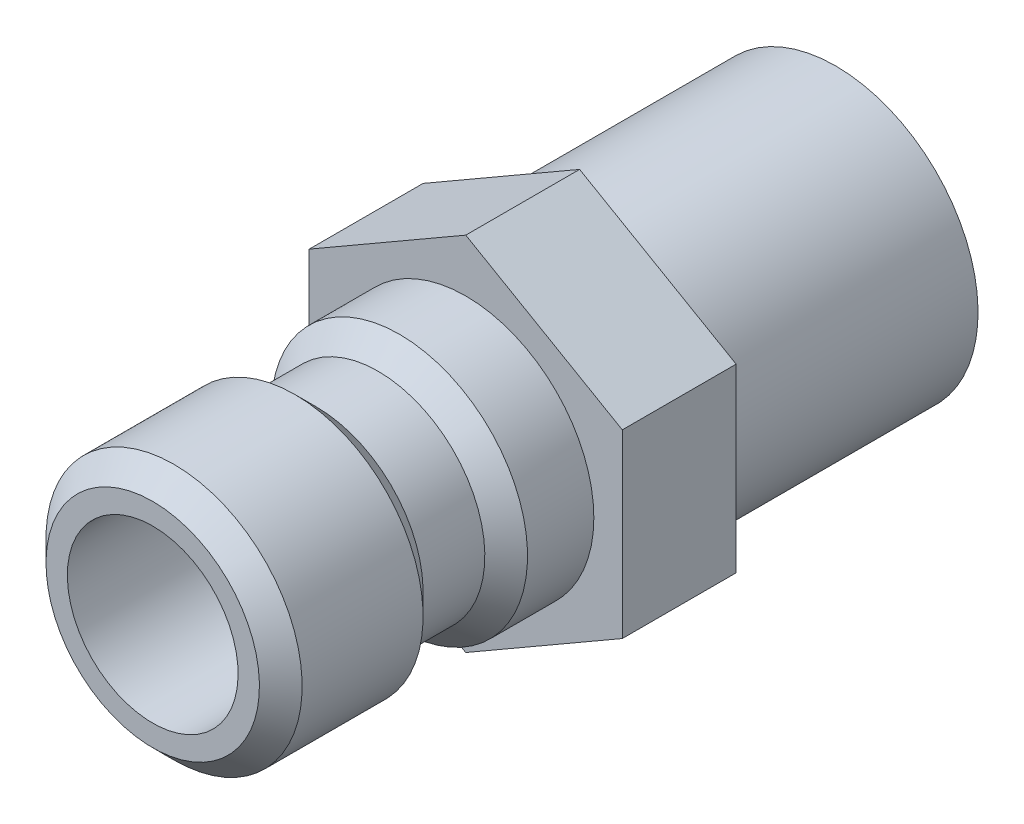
ISO-10303-21;
HEADER;
FILE_DESCRIPTION(('STEP AP214'),'2;1');
FILE_NAME('part.step','',(''),(''),'','','');
FILE_SCHEMA(('AUTOMOTIVE_DESIGN { 1 0 10303 214 1 1 1 1 }'));
ENDSEC;
DATA;
#1=APPLICATION_CONTEXT('core data for automotive mechanical design processes');
#2=APPLICATION_PROTOCOL_DEFINITION('international standard','automotive_design',2000,#1);
#3=PRODUCT_CONTEXT('',#1,'mechanical');
#4=PRODUCT('Part','Part','',(#3));
#5=PRODUCT_RELATED_PRODUCT_CATEGORY('part','',(#4));
#6=PRODUCT_DEFINITION_FORMATION('','',#4);
#7=PRODUCT_DEFINITION_CONTEXT('part definition',#1,'design');
#8=PRODUCT_DEFINITION('design','',#6,#7);
#9=PRODUCT_DEFINITION_SHAPE('','',#8);
#10=(LENGTH_UNIT() NAMED_UNIT(*) SI_UNIT(.MILLI.,.METRE.));
#11=(NAMED_UNIT(*) PLANE_ANGLE_UNIT() SI_UNIT($,.RADIAN.));
#12=(NAMED_UNIT(*) SI_UNIT($,.STERADIAN.) SOLID_ANGLE_UNIT());
#13=UNCERTAINTY_MEASURE_WITH_UNIT(LENGTH_MEASURE(1.E-05),#10,'distance_accuracy_value','');
#14=(GEOMETRIC_REPRESENTATION_CONTEXT(3) GLOBAL_UNCERTAINTY_ASSIGNED_CONTEXT((#13)) GLOBAL_UNIT_ASSIGNED_CONTEXT((#10,
#11,#12)) REPRESENTATION_CONTEXT('',''));
#15=CARTESIAN_POINT('',(0.,0.,0.));
#16=DIRECTION('',(0.,0.,1.));
#17=DIRECTION('',(1.,0.,0.));
#18=AXIS2_PLACEMENT_3D('',#15,#16,#17);
#19=CARTESIAN_POINT('',(0.,0.,-4.));
#20=DIRECTION('',(0.,0.,-1.));
#21=DIRECTION('',(0.,1.,0.));
#22=AXIS2_PLACEMENT_3D('',#19,#20,#21);
#23=CYLINDRICAL_SURFACE('',#22,3.);
#24=CARTESIAN_POINT('',(0.,0.,11.));
#25=DIRECTION('',(0.,0.,-1.));
#26=DIRECTION('',(0.,1.,0.));
#27=AXIS2_PLACEMENT_3D('',#24,#25,#26);
#28=CIRCLE('',#27,3.);
#29=CARTESIAN_POINT('',(0.,3.,11.));
#30=VERTEX_POINT('',#29);
#31=EDGE_CURVE('E40',#30,#30,#28,.T.);
#32=ORIENTED_EDGE('',*,*,#31,.F.);
#33=EDGE_LOOP('',(#32));
#34=FACE_BOUND('',#33,.T.);
#35=CARTESIAN_POINT('',(0.,0.,-13.));
#36=DIRECTION('',(0.,0.,-1.));
#37=DIRECTION('',(0.,1.,0.));
#38=AXIS2_PLACEMENT_3D('',#35,#36,#37);
#39=CIRCLE('',#38,3.);
#40=CARTESIAN_POINT('',(0.,3.,-13.));
#41=VERTEX_POINT('',#40);
#42=EDGE_CURVE('E144',#41,#41,#39,.T.);
#43=ORIENTED_EDGE('',*,*,#42,.T.);
#44=EDGE_LOOP('',(#43));
#45=FACE_BOUND('',#44,.T.);
#46=ADVANCED_FACE('F32',(#34,#45),#23,.F.);
#47=CARTESIAN_POINT('',(0.,3.,11.));
#48=DIRECTION('',(0.,0.,1.));
#49=DIRECTION('',(0.,-1.,0.));
#50=AXIS2_PLACEMENT_3D('',#47,#48,#49);
#51=PLANE('',#50);
#52=ORIENTED_EDGE('',*,*,#31,.T.);
#53=EDGE_LOOP('',(#52));
#54=FACE_BOUND('',#53,.T.);
#55=CARTESIAN_POINT('',(0.,0.,11.));
#56=DIRECTION('',(0.,0.,-1.));
#57=DIRECTION('',(0.,1.,0.));
#58=AXIS2_PLACEMENT_3D('',#55,#56,#57);
#59=CIRCLE('',#58,3.75);
#60=CARTESIAN_POINT('',(0.,3.75,11.));
#61=VERTEX_POINT('',#60);
#62=EDGE_CURVE('E165',#61,#61,#59,.T.);
#63=ORIENTED_EDGE('',*,*,#62,.F.);
#64=EDGE_LOOP('',(#63));
#65=FACE_BOUND('',#64,.T.);
#66=ADVANCED_FACE('F170',(#54,#65),#51,.T.);
#67=CARTESIAN_POINT('',(0.,0.,10.25));
#68=DIRECTION('',(0.,0.,-1.));
#69=DIRECTION('',(0.,1.,0.));
#70=AXIS2_PLACEMENT_3D('',#67,#68,#69);
#71=CONICAL_SURFACE('',#70,4.5,0.785398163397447);
#72=ORIENTED_EDGE('',*,*,#62,.T.);
#73=EDGE_LOOP('',(#72));
#74=FACE_BOUND('',#73,.T.);
#75=CARTESIAN_POINT('',(0.,0.,10.25));
#76=DIRECTION('',(0.,0.,-1.));
#77=DIRECTION('',(0.,1.,0.));
#78=AXIS2_PLACEMENT_3D('',#75,#76,#77);
#79=CIRCLE('',#78,4.5);
#80=CARTESIAN_POINT('',(0.,4.5,10.25));
#81=VERTEX_POINT('',#80);
#82=EDGE_CURVE('E162',#81,#81,#79,.T.);
#83=ORIENTED_EDGE('',*,*,#82,.F.);
#84=EDGE_LOOP('',(#83));
#85=FACE_BOUND('',#84,.T.);
#86=ADVANCED_FACE('F212',(#74,#85),#71,.T.);
#87=CARTESIAN_POINT('',(0.,0.,-4.));
#88=DIRECTION('',(0.,0.,-1.));
#89=DIRECTION('',(0.,1.,0.));
#90=AXIS2_PLACEMENT_3D('',#87,#88,#89);
#91=CYLINDRICAL_SURFACE('',#90,4.5);
#92=ORIENTED_EDGE('',*,*,#82,.T.);
#93=EDGE_LOOP('',(#92));
#94=FACE_BOUND('',#93,.T.);
#95=CARTESIAN_POINT('',(0.,0.,6.));
#96=DIRECTION('',(0.,0.,-1.));
#97=DIRECTION('',(0.,1.,0.));
#98=AXIS2_PLACEMENT_3D('',#95,#96,#97);
#99=CIRCLE('',#98,4.5);
#100=CARTESIAN_POINT('',(0.,4.5,6.));
#101=VERTEX_POINT('',#100);
#102=EDGE_CURVE('E159',#101,#101,#99,.T.);
#103=ORIENTED_EDGE('',*,*,#102,.F.);
#104=EDGE_LOOP('',(#103));
#105=FACE_BOUND('',#104,.T.);
#106=ADVANCED_FACE('F208',(#94,#105),#91,.T.);
#107=CARTESIAN_POINT('',(0.,0.,5.25));
#108=DIRECTION('',(0.,0.,1.));
#109=DIRECTION('',(0.,-1.,0.));
#110=AXIS2_PLACEMENT_3D('',#107,#108,#109);
#111=CONICAL_SURFACE('',#110,3.75,0.785398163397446);
#112=ORIENTED_EDGE('',*,*,#102,.T.);
#113=EDGE_LOOP('',(#112));
#114=FACE_BOUND('',#113,.T.);
#115=CARTESIAN_POINT('',(0.,0.,5.25));
#116=DIRECTION('',(0.,0.,-1.));
#117=DIRECTION('',(0.,1.,0.));
#118=AXIS2_PLACEMENT_3D('',#115,#116,#117);
#119=CIRCLE('',#118,3.75);
#120=CARTESIAN_POINT('',(0.,3.75,5.25));
#121=VERTEX_POINT('',#120);
#122=EDGE_CURVE('E156',#121,#121,#119,.T.);
#123=ORIENTED_EDGE('',*,*,#122,.F.);
#124=EDGE_LOOP('',(#123));
#125=FACE_BOUND('',#124,.T.);
#126=ADVANCED_FACE('F204',(#114,#125),#111,.T.);
#127=CARTESIAN_POINT('',(0.,0.,-4.));
#128=DIRECTION('',(0.,0.,-1.));
#129=DIRECTION('',(0.,1.,0.));
#130=AXIS2_PLACEMENT_3D('',#127,#128,#129);
#131=CYLINDRICAL_SURFACE('',#130,3.75);
#132=ORIENTED_EDGE('',*,*,#122,.T.);
#133=EDGE_LOOP('',(#132));
#134=FACE_BOUND('',#133,.T.);
#135=CARTESIAN_POINT('',(0.,0.,3.08));
#136=DIRECTION('',(0.,0.,-1.));
#137=DIRECTION('',(0.,1.,0.));
#138=AXIS2_PLACEMENT_3D('',#135,#136,#137);
#139=CIRCLE('',#138,3.75);
#140=CARTESIAN_POINT('',(0.,3.75,3.08));
#141=VERTEX_POINT('',#140);
#142=EDGE_CURVE('E153',#141,#141,#139,.T.);
#143=ORIENTED_EDGE('',*,*,#142,.F.);
#144=EDGE_LOOP('',(#143));
#145=FACE_BOUND('',#144,.T.);
#146=ADVANCED_FACE('F200',(#134,#145),#131,.T.);
#147=CARTESIAN_POINT('',(0.,0.,2.33));
#148=DIRECTION('',(0.,0.,-1.));
#149=DIRECTION('',(0.,1.,0.));
#150=AXIS2_PLACEMENT_3D('',#147,#148,#149);
#151=CONICAL_SURFACE('',#150,4.5,0.785398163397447);
#152=ORIENTED_EDGE('',*,*,#142,.T.);
#153=EDGE_LOOP('',(#152));
#154=FACE_BOUND('',#153,.T.);
#155=CARTESIAN_POINT('',(0.,0.,2.33));
#156=DIRECTION('',(0.,0.,-1.));
#157=DIRECTION('',(0.,1.,0.));
#158=AXIS2_PLACEMENT_3D('',#155,#156,#157);
#159=CIRCLE('',#158,4.5);
#160=CARTESIAN_POINT('',(0.,4.5,2.33));
#161=VERTEX_POINT('',#160);
#162=EDGE_CURVE('E150',#161,#161,#159,.T.);
#163=ORIENTED_EDGE('',*,*,#162,.F.);
#164=EDGE_LOOP('',(#163));
#165=FACE_BOUND('',#164,.T.);
#166=ADVANCED_FACE('F196',(#154,#165),#151,.T.);
#167=CARTESIAN_POINT('',(0.,0.,-4.));
#168=DIRECTION('',(0.,0.,-1.));
#169=DIRECTION('',(0.,1.,0.));
#170=AXIS2_PLACEMENT_3D('',#167,#168,#169);
#171=CYLINDRICAL_SURFACE('',#170,4.5);
#172=CARTESIAN_POINT('',(0.,0.,0.));
#173=DIRECTION('',(0.,0.,1.));
#174=DIRECTION('',(1.,0.,0.));
#175=AXIS2_PLACEMENT_3D('',#172,#173,#174);
#176=CIRCLE('',#175,4.5);
#177=CARTESIAN_POINT('',(4.5,0.,0.));
#178=VERTEX_POINT('',#177);
#179=EDGE_CURVE('E11',#178,#178,#176,.F.);
#180=ORIENTED_EDGE('',*,*,#179,.F.);
#181=EDGE_LOOP('',(#180));
#182=FACE_BOUND('',#181,.T.);
#183=ORIENTED_EDGE('',*,*,#162,.T.);
#184=EDGE_LOOP('',(#183));
#185=FACE_BOUND('',#184,.T.);
#186=ADVANCED_FACE('F189',(#182,#185),#171,.T.);
#187=CARTESIAN_POINT('',(0.,0.,-4.));
#188=DIRECTION('',(0.,0.,-1.));
#189=DIRECTION('',(0.,1.,0.));
#190=AXIS2_PLACEMENT_3D('',#187,#188,#189);
#191=CYLINDRICAL_SURFACE('',#190,5.);
#192=CARTESIAN_POINT('',(0.,0.,-4.));
#193=DIRECTION('',(0.,0.,1.));
#194=DIRECTION('',(1.,0.,0.));
#195=AXIS2_PLACEMENT_3D('',#192,#193,#194);
#196=CIRCLE('',#195,5.);
#197=CARTESIAN_POINT('',(5.,0.,-4.));
#198=VERTEX_POINT('',#197);
#199=EDGE_CURVE('E136',#198,#198,#196,.F.);
#200=ORIENTED_EDGE('',*,*,#199,.T.);
#201=EDGE_LOOP('',(#200));
#202=FACE_BOUND('',#201,.T.);
#203=CARTESIAN_POINT('',(0.,0.,-13.));
#204=DIRECTION('',(0.,0.,-1.));
#205=DIRECTION('',(0.,1.,0.));
#206=AXIS2_PLACEMENT_3D('',#203,#204,#205);
#207=CIRCLE('',#206,5.);
#208=CARTESIAN_POINT('',(0.,5.,-13.));
#209=VERTEX_POINT('',#208);
#210=EDGE_CURVE('E147',#209,#209,#207,.T.);
#211=ORIENTED_EDGE('',*,*,#210,.F.);
#212=EDGE_LOOP('',(#211));
#213=FACE_BOUND('',#212,.T.);
#214=ADVANCED_FACE('F180',(#202,#213),#191,.T.);
#215=CARTESIAN_POINT('',(0.,5.,-13.));
#216=DIRECTION('',(0.,0.,-1.));
#217=DIRECTION('',(0.,1.,0.));
#218=AXIS2_PLACEMENT_3D('',#215,#216,#217);
#219=PLANE('',#218);
#220=ORIENTED_EDGE('',*,*,#210,.T.);
#221=EDGE_LOOP('',(#220));
#222=FACE_BOUND('',#221,.T.);
#223=ORIENTED_EDGE('',*,*,#42,.F.);
#224=EDGE_LOOP('',(#223));
#225=FACE_BOUND('',#224,.T.);
#226=ADVANCED_FACE('F177',(#222,#225),#219,.T.);
#227=CARTESIAN_POINT('',(0.,6.35085296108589,-4.));
#228=DIRECTION('',(-0.5,0.866025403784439,0.));
#229=DIRECTION('',(-0.866025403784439,-0.5,0.));
#230=AXIS2_PLACEMENT_3D('',#227,#228,#229);
#231=PLANE('',#230);
#232=DIRECTION('',(-0.866025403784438,-0.5,0.));
#233=VECTOR('',#232,1.);
#234=CARTESIAN_POINT('',(0.,6.35085296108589,0.));
#235=LINE('',#234,#233);
#236=CARTESIAN_POINT('',(0.,6.35085296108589,0.));
#237=VERTEX_POINT('',#236);
#238=CARTESIAN_POINT('',(-5.5,3.17542648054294,0.));
#239=VERTEX_POINT('',#238);
#240=EDGE_CURVE('E119',#237,#239,#235,.T.);
#241=ORIENTED_EDGE('',*,*,#240,.F.);
#242=DIRECTION('',(0.,0.,1.));
#243=VECTOR('',#242,1.);
#244=CARTESIAN_POINT('',(0.,6.35085296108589,-4.));
#245=LINE('',#244,#243);
#246=CARTESIAN_POINT('',(0.,6.35085296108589,-4.));
#247=VERTEX_POINT('',#246);
#248=EDGE_CURVE('E48',#247,#237,#245,.T.);
#249=ORIENTED_EDGE('',*,*,#248,.F.);
#250=DIRECTION('',(-0.866025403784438,-0.5,0.));
#251=VECTOR('',#250,1.);
#252=CARTESIAN_POINT('',(0.,6.35085296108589,-4.));
#253=LINE('',#252,#251);
#254=CARTESIAN_POINT('',(-5.5,3.17542648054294,-4.));
#255=VERTEX_POINT('',#254);
#256=EDGE_CURVE('E134',#247,#255,#253,.T.);
#257=ORIENTED_EDGE('',*,*,#256,.T.);
#258=DIRECTION('',(0.,0.,1.));
#259=VECTOR('',#258,1.);
#260=CARTESIAN_POINT('',(-5.5,3.17542648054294,-4.));
#261=LINE('',#260,#259);
#262=EDGE_CURVE('E83',#255,#239,#261,.T.);
#263=ORIENTED_EDGE('',*,*,#262,.T.);
#264=EDGE_LOOP('',(#241,#249,#257,#263));
#265=FACE_BOUND('',#264,.T.);
#266=ADVANCED_FACE('F179',(#265),#231,.T.);
#267=CARTESIAN_POINT('',(5.5,3.17542648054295,-4.));
#268=DIRECTION('',(0.5,0.866025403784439,0.));
#269=DIRECTION('',(-0.866025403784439,0.5,0.));
#270=AXIS2_PLACEMENT_3D('',#267,#268,#269);
#271=PLANE('',#270);
#272=DIRECTION('',(-0.866025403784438,0.5,0.));
#273=VECTOR('',#272,1.);
#274=CARTESIAN_POINT('',(5.5,3.17542648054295,0.));
#275=LINE('',#274,#273);
#276=CARTESIAN_POINT('',(5.5,3.17542648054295,0.));
#277=VERTEX_POINT('',#276);
#278=EDGE_CURVE('E131',#277,#237,#275,.T.);
#279=ORIENTED_EDGE('',*,*,#278,.F.);
#280=DIRECTION('',(0.,0.,1.));
#281=VECTOR('',#280,1.);
#282=CARTESIAN_POINT('',(5.5,3.17542648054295,-4.));
#283=LINE('',#282,#281);
#284=CARTESIAN_POINT('',(5.5,3.17542648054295,-4.));
#285=VERTEX_POINT('',#284);
#286=EDGE_CURVE('E71',#285,#277,#283,.T.);
#287=ORIENTED_EDGE('',*,*,#286,.F.);
#288=DIRECTION('',(-0.866025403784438,0.5,0.));
#289=VECTOR('',#288,1.);
#290=CARTESIAN_POINT('',(5.5,3.17542648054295,-4.));
#291=LINE('',#290,#289);
#292=EDGE_CURVE('E109',#285,#247,#291,.T.);
#293=ORIENTED_EDGE('',*,*,#292,.T.);
#294=ORIENTED_EDGE('',*,*,#248,.T.);
#295=EDGE_LOOP('',(#279,#287,#293,#294));
#296=FACE_BOUND('',#295,.T.);
#297=ADVANCED_FACE('F187',(#296),#271,.T.);
#298=CARTESIAN_POINT('',(5.5,-3.17542648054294,-4.));
#299=DIRECTION('',(1.,0.,0.));
#300=DIRECTION('',(0.,0.,-1.));
#301=AXIS2_PLACEMENT_3D('',#298,#299,#300);
#302=PLANE('',#301);
#303=DIRECTION('',(0.,1.,0.));
#304=VECTOR('',#303,1.);
#305=CARTESIAN_POINT('',(5.5,-3.17542648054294,0.));
#306=LINE('',#305,#304);
#307=CARTESIAN_POINT('',(5.5,-3.17542648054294,0.));
#308=VERTEX_POINT('',#307);
#309=EDGE_CURVE('E96',#308,#277,#306,.T.);
#310=ORIENTED_EDGE('',*,*,#309,.F.);
#311=DIRECTION('',(0.,0.,1.));
#312=VECTOR('',#311,1.);
#313=CARTESIAN_POINT('',(5.5,-3.17542648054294,-4.));
#314=LINE('',#313,#312);
#315=CARTESIAN_POINT('',(5.5,-3.17542648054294,-4.));
#316=VERTEX_POINT('',#315);
#317=EDGE_CURVE('E91',#316,#308,#314,.T.);
#318=ORIENTED_EDGE('',*,*,#317,.F.);
#319=DIRECTION('',(0.,1.,0.));
#320=VECTOR('',#319,1.);
#321=CARTESIAN_POINT('',(5.5,-3.17542648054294,-4.));
#322=LINE('',#321,#320);
#323=EDGE_CURVE('E94',#316,#285,#322,.T.);
#324=ORIENTED_EDGE('',*,*,#323,.T.);
#325=ORIENTED_EDGE('',*,*,#286,.T.);
#326=EDGE_LOOP('',(#310,#318,#324,#325));
#327=FACE_BOUND('',#326,.T.);
#328=ADVANCED_FACE('F93',(#327),#302,.T.);
#329=CARTESIAN_POINT('',(0.,-6.35085296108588,-4.));
#330=DIRECTION('',(0.5,-0.866025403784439,0.));
#331=DIRECTION('',(0.866025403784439,0.5,0.));
#332=AXIS2_PLACEMENT_3D('',#329,#330,#331);
#333=PLANE('',#332);
#334=DIRECTION('',(0.866025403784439,0.5,0.));
#335=VECTOR('',#334,1.);
#336=CARTESIAN_POINT('',(0.,-6.35085296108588,0.));
#337=LINE('',#336,#335);
#338=CARTESIAN_POINT('',(0.,-6.35085296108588,0.));
#339=VERTEX_POINT('',#338);
#340=EDGE_CURVE('E128',#339,#308,#337,.T.);
#341=ORIENTED_EDGE('',*,*,#340,.F.);
#342=DIRECTION('',(0.,0.,1.));
#343=VECTOR('',#342,1.);
#344=CARTESIAN_POINT('',(0.,-6.35085296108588,-4.));
#345=LINE('',#344,#343);
#346=CARTESIAN_POINT('',(0.,-6.35085296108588,-4.));
#347=VERTEX_POINT('',#346);
#348=EDGE_CURVE('E101',#347,#339,#345,.T.);
#349=ORIENTED_EDGE('',*,*,#348,.F.);
#350=DIRECTION('',(0.866025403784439,0.5,0.));
#351=VECTOR('',#350,1.);
#352=CARTESIAN_POINT('',(0.,-6.35085296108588,-4.));
#353=LINE('',#352,#351);
#354=EDGE_CURVE('E107',#347,#316,#353,.T.);
#355=ORIENTED_EDGE('',*,*,#354,.T.);
#356=ORIENTED_EDGE('',*,*,#317,.T.);
#357=EDGE_LOOP('',(#341,#349,#355,#356));
#358=FACE_BOUND('',#357,.T.);
#359=ADVANCED_FACE('F111',(#358),#333,.T.);
#360=CARTESIAN_POINT('',(-5.5,-3.17542648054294,-4.));
#361=DIRECTION('',(-0.5,-0.866025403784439,0.));
#362=DIRECTION('',(0.866025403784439,-0.5,0.));
#363=AXIS2_PLACEMENT_3D('',#360,#361,#362);
#364=PLANE('',#363);
#365=DIRECTION('',(0.866025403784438,-0.5,0.));
#366=VECTOR('',#365,1.);
#367=CARTESIAN_POINT('',(-5.5,-3.17542648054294,0.));
#368=LINE('',#367,#366);
#369=CARTESIAN_POINT('',(-5.5,-3.17542648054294,0.));
#370=VERTEX_POINT('',#369);
#371=EDGE_CURVE('E125',#370,#339,#368,.T.);
#372=ORIENTED_EDGE('',*,*,#371,.F.);
#373=DIRECTION('',(0.,0.,1.));
#374=VECTOR('',#373,1.);
#375=CARTESIAN_POINT('',(-5.5,-3.17542648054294,-4.));
#376=LINE('',#375,#374);
#377=CARTESIAN_POINT('',(-5.5,-3.17542648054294,-4.));
#378=VERTEX_POINT('',#377);
#379=EDGE_CURVE('E139',#378,#370,#376,.T.);
#380=ORIENTED_EDGE('',*,*,#379,.F.);
#381=DIRECTION('',(0.866025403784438,-0.5,0.));
#382=VECTOR('',#381,1.);
#383=CARTESIAN_POINT('',(-5.5,-3.17542648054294,-4.));
#384=LINE('',#383,#382);
#385=EDGE_CURVE('E112',#378,#347,#384,.T.);
#386=ORIENTED_EDGE('',*,*,#385,.T.);
#387=ORIENTED_EDGE('',*,*,#348,.T.);
#388=EDGE_LOOP('',(#372,#380,#386,#387));
#389=FACE_BOUND('',#388,.T.);
#390=ADVANCED_FACE('F303',(#389),#364,.T.);
#391=CARTESIAN_POINT('',(-5.5,3.17542648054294,-4.));
#392=DIRECTION('',(-1.,0.,0.));
#393=DIRECTION('',(0.,0.,1.));
#394=AXIS2_PLACEMENT_3D('',#391,#392,#393);
#395=PLANE('',#394);
#396=DIRECTION('',(0.,-1.,0.));
#397=VECTOR('',#396,1.);
#398=CARTESIAN_POINT('',(-5.5,3.17542648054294,0.));
#399=LINE('',#398,#397);
#400=EDGE_CURVE('E122',#239,#370,#399,.T.);
#401=ORIENTED_EDGE('',*,*,#400,.F.);
#402=ORIENTED_EDGE('',*,*,#262,.F.);
#403=DIRECTION('',(0.,-1.,0.));
#404=VECTOR('',#403,1.);
#405=CARTESIAN_POINT('',(-5.5,3.17542648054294,-4.));
#406=LINE('',#405,#404);
#407=EDGE_CURVE('E114',#255,#378,#406,.T.);
#408=ORIENTED_EDGE('',*,*,#407,.T.);
#409=ORIENTED_EDGE('',*,*,#379,.T.);
#410=EDGE_LOOP('',(#401,#402,#408,#409));
#411=FACE_BOUND('',#410,.T.);
#412=ADVANCED_FACE('F311',(#411),#395,.T.);
#413=CARTESIAN_POINT('',(-5.5,3.17542648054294,-4.));
#414=DIRECTION('',(0.,0.,1.));
#415=DIRECTION('',(1.,0.,0.));
#416=AXIS2_PLACEMENT_3D('',#413,#414,#415);
#417=PLANE('',#416);
#418=ORIENTED_EDGE('',*,*,#199,.F.);
#419=EDGE_LOOP('',(#418));
#420=FACE_BOUND('',#419,.T.);
#421=ORIENTED_EDGE('',*,*,#256,.F.);
#422=ORIENTED_EDGE('',*,*,#292,.F.);
#423=ORIENTED_EDGE('',*,*,#323,.F.);
#424=ORIENTED_EDGE('',*,*,#354,.F.);
#425=ORIENTED_EDGE('',*,*,#385,.F.);
#426=ORIENTED_EDGE('',*,*,#407,.F.);
#427=EDGE_LOOP('',(#421,#422,#423,#424,#425,#426));
#428=FACE_BOUND('',#427,.T.);
#429=ADVANCED_FACE('F105',(#420,#428),#417,.F.);
#430=CARTESIAN_POINT('',(-5.5,3.17542648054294,0.));
#431=DIRECTION('',(0.,0.,1.));
#432=DIRECTION('',(1.,0.,0.));
#433=AXIS2_PLACEMENT_3D('',#430,#431,#432);
#434=PLANE('',#433);
#435=ORIENTED_EDGE('',*,*,#179,.T.);
#436=EDGE_LOOP('',(#435));
#437=FACE_BOUND('',#436,.T.);
#438=ORIENTED_EDGE('',*,*,#240,.T.);
#439=ORIENTED_EDGE('',*,*,#400,.T.);
#440=ORIENTED_EDGE('',*,*,#371,.T.);
#441=ORIENTED_EDGE('',*,*,#340,.T.);
#442=ORIENTED_EDGE('',*,*,#309,.T.);
#443=ORIENTED_EDGE('',*,*,#278,.T.);
#444=EDGE_LOOP('',(#438,#439,#440,#441,#442,#443));
#445=FACE_BOUND('',#444,.T.);
#446=ADVANCED_FACE('F326',(#437,#445),#434,.T.);
#447=CLOSED_SHELL('',(#46,#66,#86,#106,#126,#146,#166,#186,#214,#226,#266,#297,#328,#359,#390,
#412,#429,#446));
#448=MANIFOLD_SOLID_BREP('B2',#447);
#449=ADVANCED_BREP_SHAPE_REPRESENTATION('',(#18,#448),#14);
#450=SHAPE_DEFINITION_REPRESENTATION(#9,#449);
ENDSEC;
END-ISO-10303-21;
